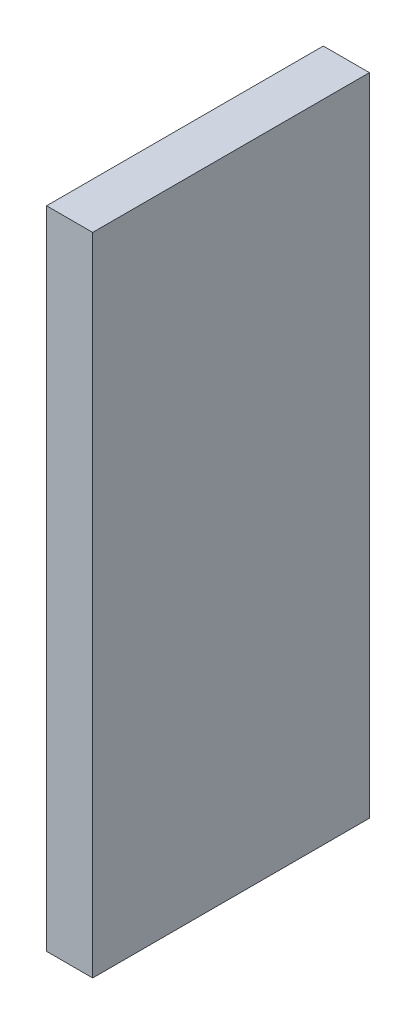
ISO-10303-21;
HEADER;
FILE_DESCRIPTION(('STEP AP214'),'2;1');
FILE_NAME('part.step','',(''),(''),'','','');
FILE_SCHEMA(('AUTOMOTIVE_DESIGN { 1 0 10303 214 1 1 1 1 }'));
ENDSEC;
DATA;
#1=APPLICATION_CONTEXT('core data for automotive mechanical design processes');
#2=APPLICATION_PROTOCOL_DEFINITION('international standard','automotive_design',2000,#1);
#3=PRODUCT_CONTEXT('',#1,'mechanical');
#4=PRODUCT('Part','Part','',(#3));
#5=PRODUCT_RELATED_PRODUCT_CATEGORY('part','',(#4));
#6=PRODUCT_DEFINITION_FORMATION('','',#4);
#7=PRODUCT_DEFINITION_CONTEXT('part definition',#1,'design');
#8=PRODUCT_DEFINITION('design','',#6,#7);
#9=PRODUCT_DEFINITION_SHAPE('','',#8);
#10=(LENGTH_UNIT() NAMED_UNIT(*) SI_UNIT(.MILLI.,.METRE.));
#11=(NAMED_UNIT(*) PLANE_ANGLE_UNIT() SI_UNIT($,.RADIAN.));
#12=(NAMED_UNIT(*) SI_UNIT($,.STERADIAN.) SOLID_ANGLE_UNIT());
#13=UNCERTAINTY_MEASURE_WITH_UNIT(LENGTH_MEASURE(1.E-05),#10,'distance_accuracy_value','');
#14=(GEOMETRIC_REPRESENTATION_CONTEXT(3) GLOBAL_UNCERTAINTY_ASSIGNED_CONTEXT((#13)) GLOBAL_UNIT_ASSIGNED_CONTEXT((#10,
#11,#12)) REPRESENTATION_CONTEXT('',''));
#15=CARTESIAN_POINT('',(0.,0.,0.));
#16=DIRECTION('',(0.,0.,1.));
#17=DIRECTION('',(1.,0.,0.));
#18=AXIS2_PLACEMENT_3D('',#15,#16,#17);
#19=CARTESIAN_POINT('',(-32.5250541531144,184.150000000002,38.1));
#20=DIRECTION('',(-1.,0.,0.));
#21=DIRECTION('',(0.,-1.,0.));
#22=AXIS2_PLACEMENT_3D('',#19,#20,#21);
#23=PLANE('',#22);
#24=DIRECTION('',(0.,1.,0.));
#25=VECTOR('',#24,1.);
#26=CARTESIAN_POINT('',(-32.5250541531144,184.150000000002,0.));
#27=LINE('',#26,#25);
#28=CARTESIAN_POINT('',(-32.5250541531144,184.150000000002,0.));
#29=VERTEX_POINT('',#28);
#30=CARTESIAN_POINT('',(-32.5250541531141,273.05,0.));
#31=VERTEX_POINT('',#30);
#32=EDGE_CURVE('E96',#29,#31,#27,.T.);
#33=ORIENTED_EDGE('',*,*,#32,.T.);
#34=DIRECTION('',(0.,0.,-1.));
#35=VECTOR('',#34,1.);
#36=CARTESIAN_POINT('',(-32.5250541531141,273.05,38.1));
#37=LINE('',#36,#35);
#38=CARTESIAN_POINT('',(-32.5250541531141,273.05,38.1));
#39=VERTEX_POINT('',#38);
#40=EDGE_CURVE('E11',#39,#31,#37,.T.);
#41=ORIENTED_EDGE('',*,*,#40,.F.);
#42=DIRECTION('',(0.,1.,0.));
#43=VECTOR('',#42,1.);
#44=CARTESIAN_POINT('',(-32.5250541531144,184.150000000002,38.1));
#45=LINE('',#44,#43);
#46=CARTESIAN_POINT('',(-32.5250541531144,184.150000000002,38.1));
#47=VERTEX_POINT('',#46);
#48=EDGE_CURVE('E84',#47,#39,#45,.T.);
#49=ORIENTED_EDGE('',*,*,#48,.F.);
#50=DIRECTION('',(0.,0.,-1.));
#51=VECTOR('',#50,1.);
#52=CARTESIAN_POINT('',(-32.5250541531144,184.150000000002,38.1));
#53=LINE('',#52,#51);
#54=EDGE_CURVE('E92',#47,#29,#53,.T.);
#55=ORIENTED_EDGE('',*,*,#54,.T.);
#56=EDGE_LOOP('',(#33,#41,#49,#55));
#57=FACE_BOUND('',#56,.T.);
#58=ADVANCED_FACE('F33',(#57),#23,.F.);
#59=CARTESIAN_POINT('',(-32.5250541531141,273.05,38.1));
#60=DIRECTION('',(0.,-1.,0.));
#61=DIRECTION('',(0.,0.,-1.));
#62=AXIS2_PLACEMENT_3D('',#59,#60,#61);
#63=PLANE('',#62);
#64=DIRECTION('',(-1.,0.,0.));
#65=VECTOR('',#64,1.);
#66=CARTESIAN_POINT('',(-32.5250541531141,273.05,0.));
#67=LINE('',#66,#65);
#68=CARTESIAN_POINT('',(-38.8750541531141,273.05,0.));
#69=VERTEX_POINT('',#68);
#70=EDGE_CURVE('E88',#31,#69,#67,.T.);
#71=ORIENTED_EDGE('',*,*,#70,.T.);
#72=DIRECTION('',(0.,0.,-1.));
#73=VECTOR('',#72,1.);
#74=CARTESIAN_POINT('',(-38.8750541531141,273.05,38.1));
#75=LINE('',#74,#73);
#76=CARTESIAN_POINT('',(-38.8750541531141,273.05,38.1));
#77=VERTEX_POINT('',#76);
#78=EDGE_CURVE('E41',#77,#69,#75,.T.);
#79=ORIENTED_EDGE('',*,*,#78,.F.);
#80=DIRECTION('',(-1.,0.,0.));
#81=VECTOR('',#80,1.);
#82=CARTESIAN_POINT('',(-32.5250541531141,273.05,38.1));
#83=LINE('',#82,#81);
#84=EDGE_CURVE('E79',#39,#77,#83,.T.);
#85=ORIENTED_EDGE('',*,*,#84,.F.);
#86=ORIENTED_EDGE('',*,*,#40,.T.);
#87=EDGE_LOOP('',(#71,#79,#85,#86));
#88=FACE_BOUND('',#87,.T.);
#89=ADVANCED_FACE('F87',(#88),#63,.F.);
#90=CARTESIAN_POINT('',(-38.8750541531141,184.150000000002,38.1));
#91=DIRECTION('',(1.,0.,0.));
#92=DIRECTION('',(0.,1.,0.));
#93=AXIS2_PLACEMENT_3D('',#90,#91,#92);
#94=PLANE('',#93);
#95=DIRECTION('',(0.,-1.,0.));
#96=VECTOR('',#95,1.);
#97=CARTESIAN_POINT('',(-38.8750541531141,184.150000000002,0.));
#98=LINE('',#97,#96);
#99=CARTESIAN_POINT('',(-38.8750541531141,184.150000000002,0.));
#100=VERTEX_POINT('',#99);
#101=EDGE_CURVE('E66',#69,#100,#98,.T.);
#102=ORIENTED_EDGE('',*,*,#101,.T.);
#103=DIRECTION('',(0.,0.,-1.));
#104=VECTOR('',#103,1.);
#105=CARTESIAN_POINT('',(-38.8750541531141,184.150000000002,38.1));
#106=LINE('',#105,#104);
#107=CARTESIAN_POINT('',(-38.8750541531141,184.150000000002,38.1));
#108=VERTEX_POINT('',#107);
#109=EDGE_CURVE('E89',#108,#100,#106,.T.);
#110=ORIENTED_EDGE('',*,*,#109,.F.);
#111=DIRECTION('',(0.,-1.,0.));
#112=VECTOR('',#111,1.);
#113=CARTESIAN_POINT('',(-38.8750541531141,184.150000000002,38.1));
#114=LINE('',#113,#112);
#115=EDGE_CURVE('E82',#77,#108,#114,.T.);
#116=ORIENTED_EDGE('',*,*,#115,.F.);
#117=ORIENTED_EDGE('',*,*,#78,.T.);
#118=EDGE_LOOP('',(#102,#110,#116,#117));
#119=FACE_BOUND('',#118,.T.);
#120=ADVANCED_FACE('F90',(#119),#94,.F.);
#121=CARTESIAN_POINT('',(-32.5250541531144,184.150000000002,38.1));
#122=DIRECTION('',(0.,1.,0.));
#123=DIRECTION('',(0.,0.,1.));
#124=AXIS2_PLACEMENT_3D('',#121,#122,#123);
#125=PLANE('',#124);
#126=DIRECTION('',(1.,0.,0.));
#127=VECTOR('',#126,1.);
#128=CARTESIAN_POINT('',(-32.5250541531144,184.150000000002,0.));
#129=LINE('',#128,#127);
#130=EDGE_CURVE('E72',#100,#29,#129,.T.);
#131=ORIENTED_EDGE('',*,*,#130,.T.);
#132=ORIENTED_EDGE('',*,*,#54,.F.);
#133=DIRECTION('',(1.,0.,0.));
#134=VECTOR('',#133,1.);
#135=CARTESIAN_POINT('',(-32.5250541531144,184.150000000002,38.1));
#136=LINE('',#135,#134);
#137=EDGE_CURVE('E49',#108,#47,#136,.T.);
#138=ORIENTED_EDGE('',*,*,#137,.F.);
#139=ORIENTED_EDGE('',*,*,#109,.T.);
#140=EDGE_LOOP('',(#131,#132,#138,#139));
#141=FACE_BOUND('',#140,.T.);
#142=ADVANCED_FACE('F103',(#141),#125,.F.);
#143=CARTESIAN_POINT('',(0.,0.,38.1));
#144=DIRECTION('',(0.,0.,1.));
#145=DIRECTION('',(1.,0.,0.));
#146=AXIS2_PLACEMENT_3D('',#143,#144,#145);
#147=PLANE('',#146);
#148=ORIENTED_EDGE('',*,*,#48,.T.);
#149=ORIENTED_EDGE('',*,*,#84,.T.);
#150=ORIENTED_EDGE('',*,*,#115,.T.);
#151=ORIENTED_EDGE('',*,*,#137,.T.);
#152=EDGE_LOOP('',(#148,#149,#150,#151));
#153=FACE_BOUND('',#152,.T.);
#154=ADVANCED_FACE('F80',(#153),#147,.T.);
#155=CARTESIAN_POINT('',(0.,0.,0.));
#156=DIRECTION('',(0.,0.,1.));
#157=DIRECTION('',(1.,0.,0.));
#158=AXIS2_PLACEMENT_3D('',#155,#156,#157);
#159=PLANE('',#158);
#160=ORIENTED_EDGE('',*,*,#32,.F.);
#161=ORIENTED_EDGE('',*,*,#130,.F.);
#162=ORIENTED_EDGE('',*,*,#101,.F.);
#163=ORIENTED_EDGE('',*,*,#70,.F.);
#164=EDGE_LOOP('',(#160,#161,#162,#163));
#165=FACE_BOUND('',#164,.T.);
#166=ADVANCED_FACE('F106',(#165),#159,.F.);
#167=CLOSED_SHELL('',(#58,#89,#120,#142,#154,#166));
#168=MANIFOLD_SOLID_BREP('B2',#167);
#169=ADVANCED_BREP_SHAPE_REPRESENTATION('',(#18,#168),#14);
#170=SHAPE_DEFINITION_REPRESENTATION(#9,#169);
ENDSEC;
END-ISO-10303-21;
